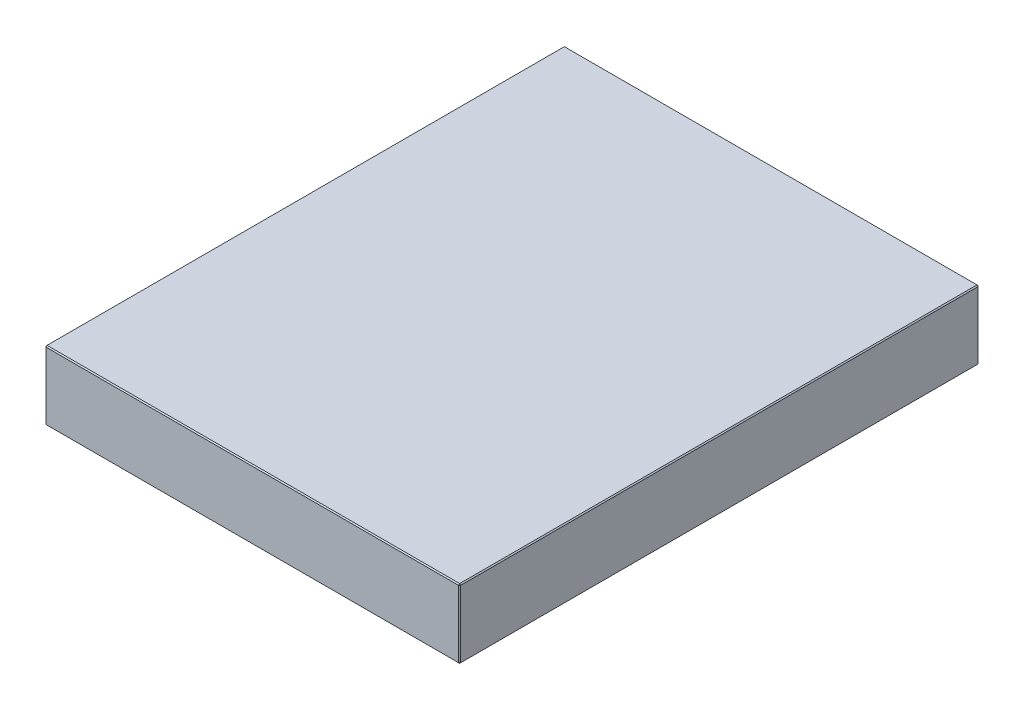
ISO-10303-21;
HEADER;
FILE_DESCRIPTION(('STEP AP214'),'2;1');
FILE_NAME('part.step','',(''),(''),'','','');
FILE_SCHEMA(('AUTOMOTIVE_DESIGN { 1 0 10303 214 1 1 1 1 }'));
ENDSEC;
DATA;
#1=APPLICATION_CONTEXT('core data for automotive mechanical design processes');
#2=APPLICATION_PROTOCOL_DEFINITION('international standard','automotive_design',2000,#1);
#3=PRODUCT_CONTEXT('',#1,'mechanical');
#4=PRODUCT('Part','Part','',(#3));
#5=PRODUCT_RELATED_PRODUCT_CATEGORY('part','',(#4));
#6=PRODUCT_DEFINITION_FORMATION('','',#4);
#7=PRODUCT_DEFINITION_CONTEXT('part definition',#1,'design');
#8=PRODUCT_DEFINITION('design','',#6,#7);
#9=PRODUCT_DEFINITION_SHAPE('','',#8);
#10=(LENGTH_UNIT() NAMED_UNIT(*) SI_UNIT(.MILLI.,.METRE.));
#11=(NAMED_UNIT(*) PLANE_ANGLE_UNIT() SI_UNIT($,.RADIAN.));
#12=(NAMED_UNIT(*) SI_UNIT($,.STERADIAN.) SOLID_ANGLE_UNIT());
#13=UNCERTAINTY_MEASURE_WITH_UNIT(LENGTH_MEASURE(1.E-05),#10,'distance_accuracy_value','');
#14=(GEOMETRIC_REPRESENTATION_CONTEXT(3) GLOBAL_UNCERTAINTY_ASSIGNED_CONTEXT((#13)) GLOBAL_UNIT_ASSIGNED_CONTEXT((#10,
#11,#12)) REPRESENTATION_CONTEXT('',''));
#15=CARTESIAN_POINT('',(0.,0.,0.));
#16=DIRECTION('',(0.,0.,1.));
#17=DIRECTION('',(1.,0.,0.));
#18=AXIS2_PLACEMENT_3D('',#15,#16,#17);
#19=CARTESIAN_POINT('',(-198.,66.,248.));
#20=DIRECTION('',(1.,0.,0.));
#21=DIRECTION('',(0.,0.,-1.));
#22=AXIS2_PLACEMENT_3D('',#19,#20,#21);
#23=PLANE('',#22);
#24=DIRECTION('',(0.,-1.,0.));
#25=VECTOR('',#24,1.);
#26=CARTESIAN_POINT('',(-198.,66.,-247.));
#27=LINE('',#26,#25);
#28=CARTESIAN_POINT('',(-198.,65.,-247.));
#29=VERTEX_POINT('',#28);
#30=CARTESIAN_POINT('',(-198.,1.00000000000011,-247.));
#31=VERTEX_POINT('',#30);
#32=EDGE_CURVE('E114',#29,#31,#27,.T.);
#33=ORIENTED_EDGE('',*,*,#32,.T.);
#34=DIRECTION('',(0.,0.,1.));
#35=VECTOR('',#34,1.);
#36=CARTESIAN_POINT('',(-198.,1.00000000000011,248.));
#37=LINE('',#36,#35);
#38=CARTESIAN_POINT('',(-198.,1.00000000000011,247.));
#39=VERTEX_POINT('',#38);
#40=EDGE_CURVE('E110',#31,#39,#37,.T.);
#41=ORIENTED_EDGE('',*,*,#40,.T.);
#42=DIRECTION('',(0.,1.,0.));
#43=VECTOR('',#42,1.);
#44=CARTESIAN_POINT('',(-198.,66.,247.));
#45=LINE('',#44,#43);
#46=CARTESIAN_POINT('',(-198.,65.,247.));
#47=VERTEX_POINT('',#46);
#48=EDGE_CURVE('E103',#39,#47,#45,.T.);
#49=ORIENTED_EDGE('',*,*,#48,.T.);
#50=DIRECTION('',(0.,0.,-1.));
#51=VECTOR('',#50,1.);
#52=CARTESIAN_POINT('',(-198.,65.,-248.));
#53=LINE('',#52,#51);
#54=EDGE_CURVE('E107',#47,#29,#53,.T.);
#55=ORIENTED_EDGE('',*,*,#54,.T.);
#56=EDGE_LOOP('',(#33,#41,#49,#55));
#57=FACE_BOUND('',#56,.T.);
#58=ADVANCED_FACE('F15',(#57),#23,.F.);
#59=CARTESIAN_POINT('',(198.,66.,248.));
#60=DIRECTION('',(0.,0.,-1.));
#61=DIRECTION('',(-1.,0.,0.));
#62=AXIS2_PLACEMENT_3D('',#59,#60,#61);
#63=PLANE('',#62);
#64=DIRECTION('',(-1.,0.,0.));
#65=VECTOR('',#64,1.);
#66=CARTESIAN_POINT('',(-198.,65.,248.));
#67=LINE('',#66,#65);
#68=CARTESIAN_POINT('',(197.,65.,248.));
#69=VERTEX_POINT('',#68);
#70=CARTESIAN_POINT('',(-197.,65.,248.));
#71=VERTEX_POINT('',#70);
#72=EDGE_CURVE('E164',#69,#71,#67,.T.);
#73=ORIENTED_EDGE('',*,*,#72,.T.);
#74=DIRECTION('',(0.,-1.,0.));
#75=VECTOR('',#74,1.);
#76=CARTESIAN_POINT('',(-197.,66.,248.));
#77=LINE('',#76,#75);
#78=CARTESIAN_POINT('',(-197.,1.00000000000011,248.));
#79=VERTEX_POINT('',#78);
#80=EDGE_CURVE('E122',#71,#79,#77,.T.);
#81=ORIENTED_EDGE('',*,*,#80,.T.);
#82=DIRECTION('',(1.,0.,0.));
#83=VECTOR('',#82,1.);
#84=CARTESIAN_POINT('',(198.,1.00000000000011,248.));
#85=LINE('',#84,#83);
#86=CARTESIAN_POINT('',(197.,1.00000000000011,248.));
#87=VERTEX_POINT('',#86);
#88=EDGE_CURVE('E168',#79,#87,#85,.T.);
#89=ORIENTED_EDGE('',*,*,#88,.T.);
#90=DIRECTION('',(0.,1.,0.));
#91=VECTOR('',#90,1.);
#92=CARTESIAN_POINT('',(197.,66.,248.));
#93=LINE('',#92,#91);
#94=EDGE_CURVE('E166',#87,#69,#93,.T.);
#95=ORIENTED_EDGE('',*,*,#94,.T.);
#96=EDGE_LOOP('',(#73,#81,#89,#95));
#97=FACE_BOUND('',#96,.T.);
#98=ADVANCED_FACE('F275',(#97),#63,.F.);
#99=CARTESIAN_POINT('',(198.,66.,248.));
#100=DIRECTION('',(-1.,0.,0.));
#101=DIRECTION('',(0.,0.,1.));
#102=AXIS2_PLACEMENT_3D('',#99,#100,#101);
#103=PLANE('',#102);
#104=DIRECTION('',(0.,0.,-1.));
#105=VECTOR('',#104,1.);
#106=CARTESIAN_POINT('',(198.,1.00000000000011,248.));
#107=LINE('',#106,#105);
#108=CARTESIAN_POINT('',(198.,1.00000000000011,247.));
#109=VERTEX_POINT('',#108);
#110=CARTESIAN_POINT('',(198.,1.00000000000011,-247.));
#111=VERTEX_POINT('',#110);
#112=EDGE_CURVE('E159',#109,#111,#107,.T.);
#113=ORIENTED_EDGE('',*,*,#112,.T.);
#114=DIRECTION('',(0.,1.,0.));
#115=VECTOR('',#114,1.);
#116=CARTESIAN_POINT('',(198.,66.,-247.));
#117=LINE('',#116,#115);
#118=CARTESIAN_POINT('',(198.,65.,-247.));
#119=VERTEX_POINT('',#118);
#120=EDGE_CURVE('E161',#111,#119,#117,.T.);
#121=ORIENTED_EDGE('',*,*,#120,.T.);
#122=DIRECTION('',(0.,0.,1.));
#123=VECTOR('',#122,1.);
#124=CARTESIAN_POINT('',(198.,65.,248.));
#125=LINE('',#124,#123);
#126=CARTESIAN_POINT('',(198.,65.,247.));
#127=VERTEX_POINT('',#126);
#128=EDGE_CURVE('E155',#119,#127,#125,.T.);
#129=ORIENTED_EDGE('',*,*,#128,.T.);
#130=DIRECTION('',(0.,-1.,0.));
#131=VECTOR('',#130,1.);
#132=CARTESIAN_POINT('',(198.,66.,247.));
#133=LINE('',#132,#131);
#134=EDGE_CURVE('E157',#127,#109,#133,.T.);
#135=ORIENTED_EDGE('',*,*,#134,.T.);
#136=EDGE_LOOP('',(#113,#121,#129,#135));
#137=FACE_BOUND('',#136,.T.);
#138=ADVANCED_FACE('F254',(#137),#103,.F.);
#139=CARTESIAN_POINT('',(198.,66.,-248.));
#140=DIRECTION('',(0.,0.,1.));
#141=DIRECTION('',(1.,0.,0.));
#142=AXIS2_PLACEMENT_3D('',#139,#140,#141);
#143=PLANE('',#142);
#144=DIRECTION('',(0.,-1.,0.));
#145=VECTOR('',#144,1.);
#146=CARTESIAN_POINT('',(197.,66.,-248.));
#147=LINE('',#146,#145);
#148=CARTESIAN_POINT('',(197.,65.,-248.));
#149=VERTEX_POINT('',#148);
#150=CARTESIAN_POINT('',(197.,1.00000000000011,-248.));
#151=VERTEX_POINT('',#150);
#152=EDGE_CURVE('E148',#149,#151,#147,.T.);
#153=ORIENTED_EDGE('',*,*,#152,.T.);
#154=DIRECTION('',(-1.,0.,0.));
#155=VECTOR('',#154,1.);
#156=CARTESIAN_POINT('',(198.,1.00000000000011,-248.));
#157=LINE('',#156,#155);
#158=CARTESIAN_POINT('',(-197.,1.00000000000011,-248.));
#159=VERTEX_POINT('',#158);
#160=EDGE_CURVE('E153',#151,#159,#157,.T.);
#161=ORIENTED_EDGE('',*,*,#160,.T.);
#162=DIRECTION('',(0.,1.,0.));
#163=VECTOR('',#162,1.);
#164=CARTESIAN_POINT('',(-197.,66.,-248.));
#165=LINE('',#164,#163);
#166=CARTESIAN_POINT('',(-197.,65.,-248.));
#167=VERTEX_POINT('',#166);
#168=EDGE_CURVE('E150',#159,#167,#165,.T.);
#169=ORIENTED_EDGE('',*,*,#168,.T.);
#170=DIRECTION('',(1.,0.,0.));
#171=VECTOR('',#170,1.);
#172=CARTESIAN_POINT('',(198.,65.,-248.));
#173=LINE('',#172,#171);
#174=EDGE_CURVE('E146',#167,#149,#173,.T.);
#175=ORIENTED_EDGE('',*,*,#174,.T.);
#176=EDGE_LOOP('',(#153,#161,#169,#175));
#177=FACE_BOUND('',#176,.T.);
#178=ADVANCED_FACE('F284',(#177),#143,.F.);
#179=CARTESIAN_POINT('',(0.,66.,0.));
#180=DIRECTION('',(0.,1.,0.));
#181=DIRECTION('',(0.,0.,1.));
#182=AXIS2_PLACEMENT_3D('',#179,#180,#181);
#183=PLANE('',#182);
#184=DIRECTION('',(0.,0.,-1.));
#185=VECTOR('',#184,1.);
#186=CARTESIAN_POINT('',(197.,66.,-248.));
#187=LINE('',#186,#185);
#188=CARTESIAN_POINT('',(197.,66.,247.));
#189=VERTEX_POINT('',#188);
#190=CARTESIAN_POINT('',(197.,66.,-247.));
#191=VERTEX_POINT('',#190);
#192=EDGE_CURVE('E24',#189,#191,#187,.T.);
#193=ORIENTED_EDGE('',*,*,#192,.T.);
#194=DIRECTION('',(-1.,0.,0.));
#195=VECTOR('',#194,1.);
#196=CARTESIAN_POINT('',(-198.,66.,-247.));
#197=LINE('',#196,#195);
#198=CARTESIAN_POINT('',(-197.,66.,-247.));
#199=VERTEX_POINT('',#198);
#200=EDGE_CURVE('E9',#191,#199,#197,.T.);
#201=ORIENTED_EDGE('',*,*,#200,.T.);
#202=DIRECTION('',(0.,0.,1.));
#203=VECTOR('',#202,1.);
#204=CARTESIAN_POINT('',(-197.,66.,248.));
#205=LINE('',#204,#203);
#206=CARTESIAN_POINT('',(-197.,66.,247.));
#207=VERTEX_POINT('',#206);
#208=EDGE_CURVE('E180',#199,#207,#205,.T.);
#209=ORIENTED_EDGE('',*,*,#208,.T.);
#210=DIRECTION('',(1.,0.,0.));
#211=VECTOR('',#210,1.);
#212=CARTESIAN_POINT('',(198.,66.,247.));
#213=LINE('',#212,#211);
#214=EDGE_CURVE('E35',#207,#189,#213,.T.);
#215=ORIENTED_EDGE('',*,*,#214,.T.);
#216=EDGE_LOOP('',(#193,#201,#209,#215));
#217=FACE_BOUND('',#216,.T.);
#218=ADVANCED_FACE('F350',(#217),#183,.T.);
#219=CARTESIAN_POINT('',(0.,0.,0.));
#220=DIRECTION('',(0.,1.,0.));
#221=DIRECTION('',(0.,0.,1.));
#222=AXIS2_PLACEMENT_3D('',#219,#220,#221);
#223=PLANE('',#222);
#224=DIRECTION('',(0.,0.,1.));
#225=VECTOR('',#224,1.);
#226=CARTESIAN_POINT('',(197.,0.,0.));
#227=LINE('',#226,#225);
#228=CARTESIAN_POINT('',(197.,0.,-247.));
#229=VERTEX_POINT('',#228);
#230=CARTESIAN_POINT('',(197.,0.,247.));
#231=VERTEX_POINT('',#230);
#232=EDGE_CURVE('E171',#229,#231,#227,.T.);
#233=ORIENTED_EDGE('',*,*,#232,.T.);
#234=DIRECTION('',(-1.,0.,0.));
#235=VECTOR('',#234,1.);
#236=CARTESIAN_POINT('',(0.,0.,247.));
#237=LINE('',#236,#235);
#238=CARTESIAN_POINT('',(-197.,0.,247.));
#239=VERTEX_POINT('',#238);
#240=EDGE_CURVE('E177',#231,#239,#237,.T.);
#241=ORIENTED_EDGE('',*,*,#240,.T.);
#242=DIRECTION('',(0.,0.,-1.));
#243=VECTOR('',#242,1.);
#244=CARTESIAN_POINT('',(-197.,0.,0.));
#245=LINE('',#244,#243);
#246=CARTESIAN_POINT('',(-197.,0.,-247.));
#247=VERTEX_POINT('',#246);
#248=EDGE_CURVE('E175',#239,#247,#245,.T.);
#249=ORIENTED_EDGE('',*,*,#248,.T.);
#250=DIRECTION('',(1.,0.,0.));
#251=VECTOR('',#250,1.);
#252=CARTESIAN_POINT('',(0.,0.,-247.));
#253=LINE('',#252,#251);
#254=EDGE_CURVE('E173',#247,#229,#253,.T.);
#255=ORIENTED_EDGE('',*,*,#254,.T.);
#256=EDGE_LOOP('',(#233,#241,#249,#255));
#257=FACE_BOUND('',#256,.T.);
#258=ADVANCED_FACE('F246',(#257),#223,.F.);
#259=CARTESIAN_POINT('',(198.,66.,247.));
#260=DIRECTION('',(-0.707106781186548,0.,-0.707106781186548));
#261=DIRECTION('',(0.,-1.,0.));
#262=AXIS2_PLACEMENT_3D('',#259,#260,#261);
#263=PLANE('',#262);
#264=DIRECTION('',(-0.707106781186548,0.,0.707106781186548));
#265=VECTOR('',#264,1.);
#266=CARTESIAN_POINT('',(197.,65.,248.));
#267=LINE('',#266,#265);
#268=EDGE_CURVE('E19',#69,#127,#267,.F.);
#269=ORIENTED_EDGE('',*,*,#268,.F.);
#270=ORIENTED_EDGE('',*,*,#94,.F.);
#271=DIRECTION('',(0.707106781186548,0.,-0.707106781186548));
#272=VECTOR('',#271,1.);
#273=CARTESIAN_POINT('',(197.,1.00000000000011,248.));
#274=LINE('',#273,#272);
#275=EDGE_CURVE('E142',#109,#87,#274,.F.);
#276=ORIENTED_EDGE('',*,*,#275,.F.);
#277=ORIENTED_EDGE('',*,*,#134,.F.);
#278=EDGE_LOOP('',(#269,#270,#276,#277));
#279=FACE_BOUND('',#278,.T.);
#280=ADVANCED_FACE('F17',(#279),#263,.F.);
#281=CARTESIAN_POINT('',(197.,65.,248.));
#282=DIRECTION('',(0.577350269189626,0.577350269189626,0.577350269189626));
#283=DIRECTION('',(0.707106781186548,0.,-0.707106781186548));
#284=AXIS2_PLACEMENT_3D('',#281,#282,#283);
#285=PLANE('',#284);
#286=DIRECTION('',(0.,-0.707106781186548,0.707106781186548));
#287=VECTOR('',#286,1.);
#288=CARTESIAN_POINT('',(197.,65.,248.));
#289=LINE('',#288,#287);
#290=EDGE_CURVE('E226',#69,#189,#289,.F.);
#291=ORIENTED_EDGE('',*,*,#290,.F.);
#292=ORIENTED_EDGE('',*,*,#268,.T.);
#293=DIRECTION('',(-0.707106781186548,0.707106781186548,0.));
#294=VECTOR('',#293,1.);
#295=CARTESIAN_POINT('',(197.5,65.5,247.));
#296=LINE('',#295,#294);
#297=EDGE_CURVE('E228',#189,#127,#296,.F.);
#298=ORIENTED_EDGE('',*,*,#297,.F.);
#299=EDGE_LOOP('',(#291,#292,#298));
#300=FACE_BOUND('',#299,.T.);
#301=ADVANCED_FACE('F270',(#300),#285,.T.);
#302=CARTESIAN_POINT('',(197.,1.00000000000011,248.));
#303=DIRECTION('',(0.577350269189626,-0.577350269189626,0.577350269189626));
#304=DIRECTION('',(0.707106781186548,0.,-0.707106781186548));
#305=AXIS2_PLACEMENT_3D('',#302,#303,#304);
#306=PLANE('',#305);
#307=DIRECTION('',(-0.707106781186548,-0.707106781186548,0.));
#308=VECTOR('',#307,1.);
#309=CARTESIAN_POINT('',(197.5,0.500000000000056,247.));
#310=LINE('',#309,#308);
#311=EDGE_CURVE('E220',#109,#231,#310,.T.);
#312=ORIENTED_EDGE('',*,*,#311,.F.);
#313=ORIENTED_EDGE('',*,*,#275,.T.);
#314=DIRECTION('',(0.,0.707106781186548,0.707106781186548));
#315=VECTOR('',#314,1.);
#316=CARTESIAN_POINT('',(197.,1.00000000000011,248.));
#317=LINE('',#316,#315);
#318=EDGE_CURVE('E223',#231,#87,#317,.T.);
#319=ORIENTED_EDGE('',*,*,#318,.F.);
#320=EDGE_LOOP('',(#312,#313,#319));
#321=FACE_BOUND('',#320,.T.);
#322=ADVANCED_FACE('F235',(#321),#306,.T.);
#323=CARTESIAN_POINT('',(197.,66.,0.));
#324=DIRECTION('',(0.707106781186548,0.707106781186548,0.));
#325=DIRECTION('',(0.,0.,1.));
#326=AXIS2_PLACEMENT_3D('',#323,#324,#325);
#327=PLANE('',#326);
#328=ORIENTED_EDGE('',*,*,#297,.T.);
#329=ORIENTED_EDGE('',*,*,#128,.F.);
#330=DIRECTION('',(0.707106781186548,-0.707106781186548,0.));
#331=VECTOR('',#330,1.);
#332=CARTESIAN_POINT('',(198.,65.,-247.));
#333=LINE('',#332,#331);
#334=EDGE_CURVE('E215',#191,#119,#333,.T.);
#335=ORIENTED_EDGE('',*,*,#334,.F.);
#336=ORIENTED_EDGE('',*,*,#192,.F.);
#337=EDGE_LOOP('',(#328,#329,#335,#336));
#338=FACE_BOUND('',#337,.T.);
#339=ADVANCED_FACE('F265',(#338),#327,.T.);
#340=CARTESIAN_POINT('',(0.,66.,247.));
#341=DIRECTION('',(0.,0.707106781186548,0.707106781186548));
#342=DIRECTION('',(-1.,0.,0.));
#343=AXIS2_PLACEMENT_3D('',#340,#341,#342);
#344=PLANE('',#343);
#345=ORIENTED_EDGE('',*,*,#290,.T.);
#346=ORIENTED_EDGE('',*,*,#214,.F.);
#347=DIRECTION('',(0.,0.707106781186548,-0.707106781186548));
#348=VECTOR('',#347,1.);
#349=CARTESIAN_POINT('',(-197.,65.5,247.5));
#350=LINE('',#349,#348);
#351=EDGE_CURVE('E126',#71,#207,#350,.T.);
#352=ORIENTED_EDGE('',*,*,#351,.F.);
#353=ORIENTED_EDGE('',*,*,#72,.F.);
#354=EDGE_LOOP('',(#345,#346,#352,#353));
#355=FACE_BOUND('',#354,.T.);
#356=ADVANCED_FACE('F273',(#355),#344,.T.);
#357=CARTESIAN_POINT('',(-197.,66.,248.));
#358=DIRECTION('',(0.707106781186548,0.,-0.707106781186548));
#359=DIRECTION('',(0.,-1.,0.));
#360=AXIS2_PLACEMENT_3D('',#357,#358,#359);
#361=PLANE('',#360);
#362=DIRECTION('',(0.707106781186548,0.,0.707106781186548));
#363=VECTOR('',#362,1.);
#364=CARTESIAN_POINT('',(-197.,1.00000000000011,248.));
#365=LINE('',#364,#363);
#366=EDGE_CURVE('E127',#79,#39,#365,.F.);
#367=ORIENTED_EDGE('',*,*,#366,.F.);
#368=ORIENTED_EDGE('',*,*,#80,.F.);
#369=DIRECTION('',(-0.707106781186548,0.,-0.707106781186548));
#370=VECTOR('',#369,1.);
#371=CARTESIAN_POINT('',(-198.,65.,247.));
#372=LINE('',#371,#370);
#373=EDGE_CURVE('E118',#47,#71,#372,.F.);
#374=ORIENTED_EDGE('',*,*,#373,.F.);
#375=ORIENTED_EDGE('',*,*,#48,.F.);
#376=EDGE_LOOP('',(#367,#368,#374,#375));
#377=FACE_BOUND('',#376,.T.);
#378=ADVANCED_FACE('F120',(#377),#361,.F.);
#379=CARTESIAN_POINT('',(198.,1.00000000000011,248.));
#380=DIRECTION('',(0.,0.707106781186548,-0.707106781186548));
#381=DIRECTION('',(1.,0.,0.));
#382=AXIS2_PLACEMENT_3D('',#379,#380,#381);
#383=PLANE('',#382);
#384=ORIENTED_EDGE('',*,*,#318,.T.);
#385=ORIENTED_EDGE('',*,*,#88,.F.);
#386=DIRECTION('',(0.,-0.707106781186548,-0.707106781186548));
#387=VECTOR('',#386,1.);
#388=CARTESIAN_POINT('',(-197.,1.00000000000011,248.));
#389=LINE('',#388,#387);
#390=EDGE_CURVE('E211',#239,#79,#389,.F.);
#391=ORIENTED_EDGE('',*,*,#390,.F.);
#392=ORIENTED_EDGE('',*,*,#240,.F.);
#393=EDGE_LOOP('',(#384,#385,#391,#392));
#394=FACE_BOUND('',#393,.T.);
#395=ADVANCED_FACE('F243',(#394),#383,.F.);
#396=CARTESIAN_POINT('',(198.,1.00000000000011,248.));
#397=DIRECTION('',(-0.707106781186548,0.707106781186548,0.));
#398=DIRECTION('',(0.,0.,-1.));
#399=AXIS2_PLACEMENT_3D('',#396,#397,#398);
#400=PLANE('',#399);
#401=ORIENTED_EDGE('',*,*,#311,.T.);
#402=ORIENTED_EDGE('',*,*,#232,.F.);
#403=DIRECTION('',(0.707106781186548,0.707106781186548,0.));
#404=VECTOR('',#403,1.);
#405=CARTESIAN_POINT('',(197.5,0.50000000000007,-247.));
#406=LINE('',#405,#404);
#407=EDGE_CURVE('E208',#111,#229,#406,.F.);
#408=ORIENTED_EDGE('',*,*,#407,.F.);
#409=ORIENTED_EDGE('',*,*,#112,.F.);
#410=EDGE_LOOP('',(#401,#402,#408,#409));
#411=FACE_BOUND('',#410,.T.);
#412=ADVANCED_FACE('F251',(#411),#400,.F.);
#413=CARTESIAN_POINT('',(197.,66.,-248.));
#414=DIRECTION('',(-0.707106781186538,0.,0.707106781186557));
#415=DIRECTION('',(0.,-1.,0.));
#416=AXIS2_PLACEMENT_3D('',#413,#414,#415);
#417=PLANE('',#416);
#418=DIRECTION('',(0.707106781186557,0.,0.707106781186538));
#419=VECTOR('',#418,1.);
#420=CARTESIAN_POINT('',(198.,65.,-247.));
#421=LINE('',#420,#419);
#422=EDGE_CURVE('E217',#119,#149,#421,.F.);
#423=ORIENTED_EDGE('',*,*,#422,.F.);
#424=ORIENTED_EDGE('',*,*,#120,.F.);
#425=DIRECTION('',(-0.707106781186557,0.,-0.707106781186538));
#426=VECTOR('',#425,1.);
#427=CARTESIAN_POINT('',(197.,1.00000000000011,-248.));
#428=LINE('',#427,#426);
#429=EDGE_CURVE('E205',#151,#111,#428,.F.);
#430=ORIENTED_EDGE('',*,*,#429,.F.);
#431=ORIENTED_EDGE('',*,*,#152,.F.);
#432=EDGE_LOOP('',(#423,#424,#430,#431));
#433=FACE_BOUND('',#432,.T.);
#434=ADVANCED_FACE('F258',(#433),#417,.F.);
#435=CARTESIAN_POINT('',(198.,65.,-247.));
#436=DIRECTION('',(0.577350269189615,0.577350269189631,-0.577350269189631));
#437=DIRECTION('',(0.,0.707106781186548,0.707106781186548));
#438=AXIS2_PLACEMENT_3D('',#435,#436,#437);
#439=PLANE('',#438);
#440=ORIENTED_EDGE('',*,*,#334,.T.);
#441=ORIENTED_EDGE('',*,*,#422,.T.);
#442=DIRECTION('',(0.,0.707106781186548,0.707106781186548));
#443=VECTOR('',#442,1.);
#444=CARTESIAN_POINT('',(197.,65.5,-247.5));
#445=LINE('',#444,#443);
#446=EDGE_CURVE('E134',#191,#149,#445,.F.);
#447=ORIENTED_EDGE('',*,*,#446,.F.);
#448=EDGE_LOOP('',(#440,#441,#447));
#449=FACE_BOUND('',#448,.T.);
#450=ADVANCED_FACE('F325',(#449),#439,.T.);
#451=CARTESIAN_POINT('',(-198.,65.,247.));
#452=DIRECTION('',(-0.577350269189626,0.577350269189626,0.577350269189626));
#453=DIRECTION('',(0.707106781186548,0.,0.707106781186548));
#454=AXIS2_PLACEMENT_3D('',#451,#452,#453);
#455=PLANE('',#454);
#456=ORIENTED_EDGE('',*,*,#373,.T.);
#457=ORIENTED_EDGE('',*,*,#351,.T.);
#458=DIRECTION('',(-0.707106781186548,-0.707106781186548,0.));
#459=VECTOR('',#458,1.);
#460=CARTESIAN_POINT('',(-198.,65.,247.));
#461=LINE('',#460,#459);
#462=EDGE_CURVE('E130',#47,#207,#461,.F.);
#463=ORIENTED_EDGE('',*,*,#462,.F.);
#464=EDGE_LOOP('',(#456,#457,#463));
#465=FACE_BOUND('',#464,.T.);
#466=ADVANCED_FACE('F131',(#465),#455,.T.);
#467=CARTESIAN_POINT('',(-197.,1.00000000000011,248.));
#468=DIRECTION('',(-0.577350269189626,-0.577350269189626,0.577350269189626));
#469=DIRECTION('',(0.707106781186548,0.,0.707106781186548));
#470=AXIS2_PLACEMENT_3D('',#467,#468,#469);
#471=PLANE('',#470);
#472=ORIENTED_EDGE('',*,*,#390,.T.);
#473=ORIENTED_EDGE('',*,*,#366,.T.);
#474=DIRECTION('',(-0.707106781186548,0.707106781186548,0.));
#475=VECTOR('',#474,1.);
#476=CARTESIAN_POINT('',(-197.5,0.500000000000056,247.));
#477=LINE('',#476,#475);
#478=EDGE_CURVE('E135',#239,#39,#477,.T.);
#479=ORIENTED_EDGE('',*,*,#478,.F.);
#480=EDGE_LOOP('',(#472,#473,#479));
#481=FACE_BOUND('',#480,.T.);
#482=ADVANCED_FACE('F318',(#481),#471,.T.);
#483=CARTESIAN_POINT('',(197.,1.00000000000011,-248.));
#484=DIRECTION('',(0.577350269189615,-0.577350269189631,-0.577350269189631));
#485=DIRECTION('',(0.,0.707106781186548,-0.707106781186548));
#486=AXIS2_PLACEMENT_3D('',#483,#484,#485);
#487=PLANE('',#486);
#488=ORIENTED_EDGE('',*,*,#429,.T.);
#489=ORIENTED_EDGE('',*,*,#407,.T.);
#490=DIRECTION('',(0.,-0.707106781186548,0.707106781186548));
#491=VECTOR('',#490,1.);
#492=CARTESIAN_POINT('',(197.,1.00000000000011,-248.));
#493=LINE('',#492,#491);
#494=EDGE_CURVE('E198',#151,#229,#493,.T.);
#495=ORIENTED_EDGE('',*,*,#494,.F.);
#496=EDGE_LOOP('',(#488,#489,#495));
#497=FACE_BOUND('',#496,.T.);
#498=ADVANCED_FACE('F314',(#497),#487,.T.);
#499=CARTESIAN_POINT('',(0.,66.,-247.));
#500=DIRECTION('',(0.,0.707106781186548,-0.707106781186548));
#501=DIRECTION('',(1.,0.,0.));
#502=AXIS2_PLACEMENT_3D('',#499,#500,#501);
#503=PLANE('',#502);
#504=ORIENTED_EDGE('',*,*,#446,.T.);
#505=ORIENTED_EDGE('',*,*,#174,.F.);
#506=DIRECTION('',(0.,-0.707106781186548,-0.707106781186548));
#507=VECTOR('',#506,1.);
#508=CARTESIAN_POINT('',(-197.,65.,-248.));
#509=LINE('',#508,#507);
#510=EDGE_CURVE('E195',#199,#167,#509,.T.);
#511=ORIENTED_EDGE('',*,*,#510,.F.);
#512=ORIENTED_EDGE('',*,*,#200,.F.);
#513=EDGE_LOOP('',(#504,#505,#511,#512));
#514=FACE_BOUND('',#513,.T.);
#515=ADVANCED_FACE('F311',(#514),#503,.T.);
#516=CARTESIAN_POINT('',(-197.,66.,0.));
#517=DIRECTION('',(-0.707106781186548,0.707106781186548,0.));
#518=DIRECTION('',(0.,0.,-1.));
#519=AXIS2_PLACEMENT_3D('',#516,#517,#518);
#520=PLANE('',#519);
#521=ORIENTED_EDGE('',*,*,#462,.T.);
#522=ORIENTED_EDGE('',*,*,#208,.F.);
#523=DIRECTION('',(0.707106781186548,0.707106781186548,0.));
#524=VECTOR('',#523,1.);
#525=CARTESIAN_POINT('',(-197.5,65.5,-247.));
#526=LINE('',#525,#524);
#527=EDGE_CURVE('E138',#29,#199,#526,.T.);
#528=ORIENTED_EDGE('',*,*,#527,.F.);
#529=ORIENTED_EDGE('',*,*,#54,.F.);
#530=EDGE_LOOP('',(#521,#522,#528,#529));
#531=FACE_BOUND('',#530,.T.);
#532=ADVANCED_FACE('F137',(#531),#520,.T.);
#533=CARTESIAN_POINT('',(-198.,1.00000000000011,248.));
#534=DIRECTION('',(0.707106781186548,0.707106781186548,0.));
#535=DIRECTION('',(0.,0.,1.));
#536=AXIS2_PLACEMENT_3D('',#533,#534,#535);
#537=PLANE('',#536);
#538=ORIENTED_EDGE('',*,*,#478,.T.);
#539=ORIENTED_EDGE('',*,*,#40,.F.);
#540=DIRECTION('',(0.707106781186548,-0.707106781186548,0.));
#541=VECTOR('',#540,1.);
#542=CARTESIAN_POINT('',(-198.,1.00000000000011,-247.));
#543=LINE('',#542,#541);
#544=EDGE_CURVE('E191',#247,#31,#543,.F.);
#545=ORIENTED_EDGE('',*,*,#544,.F.);
#546=ORIENTED_EDGE('',*,*,#248,.F.);
#547=EDGE_LOOP('',(#538,#539,#545,#546));
#548=FACE_BOUND('',#547,.T.);
#549=ADVANCED_FACE('F304',(#548),#537,.F.);
#550=CARTESIAN_POINT('',(198.,1.00000000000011,-248.));
#551=DIRECTION('',(0.,0.707106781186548,0.707106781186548));
#552=DIRECTION('',(-1.,0.,0.));
#553=AXIS2_PLACEMENT_3D('',#550,#551,#552);
#554=PLANE('',#553);
#555=ORIENTED_EDGE('',*,*,#494,.T.);
#556=ORIENTED_EDGE('',*,*,#254,.F.);
#557=DIRECTION('',(0.,0.707106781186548,-0.707106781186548));
#558=VECTOR('',#557,1.);
#559=CARTESIAN_POINT('',(-197.,0.500000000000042,-247.5));
#560=LINE('',#559,#558);
#561=EDGE_CURVE('E188',#159,#247,#560,.F.);
#562=ORIENTED_EDGE('',*,*,#561,.F.);
#563=ORIENTED_EDGE('',*,*,#160,.F.);
#564=EDGE_LOOP('',(#555,#556,#562,#563));
#565=FACE_BOUND('',#564,.T.);
#566=ADVANCED_FACE('F300',(#565),#554,.F.);
#567=CARTESIAN_POINT('',(-197.,65.,-248.));
#568=DIRECTION('',(-0.577350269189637,0.577350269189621,-0.577350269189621));
#569=DIRECTION('',(-0.707106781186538,0.,0.707106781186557));
#570=AXIS2_PLACEMENT_3D('',#567,#568,#569);
#571=PLANE('',#570);
#572=ORIENTED_EDGE('',*,*,#527,.T.);
#573=ORIENTED_EDGE('',*,*,#510,.T.);
#574=DIRECTION('',(0.707106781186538,0.,-0.707106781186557));
#575=VECTOR('',#574,1.);
#576=CARTESIAN_POINT('',(-197.,65.,-248.));
#577=LINE('',#576,#575);
#578=EDGE_CURVE('E186',#29,#167,#577,.T.);
#579=ORIENTED_EDGE('',*,*,#578,.F.);
#580=EDGE_LOOP('',(#572,#573,#579));
#581=FACE_BOUND('',#580,.T.);
#582=ADVANCED_FACE('F296',(#581),#571,.T.);
#583=CARTESIAN_POINT('',(-198.,1.00000000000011,-247.));
#584=DIRECTION('',(-0.577350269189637,-0.577350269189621,-0.577350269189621));
#585=DIRECTION('',(-0.707106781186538,0.,0.707106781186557));
#586=AXIS2_PLACEMENT_3D('',#583,#584,#585);
#587=PLANE('',#586);
#588=ORIENTED_EDGE('',*,*,#561,.T.);
#589=ORIENTED_EDGE('',*,*,#544,.T.);
#590=DIRECTION('',(-0.707106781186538,0.,0.707106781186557));
#591=VECTOR('',#590,1.);
#592=CARTESIAN_POINT('',(-198.,1.00000000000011,-247.));
#593=LINE('',#592,#591);
#594=EDGE_CURVE('E184',#159,#31,#593,.T.);
#595=ORIENTED_EDGE('',*,*,#594,.F.);
#596=EDGE_LOOP('',(#588,#589,#595));
#597=FACE_BOUND('',#596,.T.);
#598=ADVANCED_FACE('F292',(#597),#587,.T.);
#599=CARTESIAN_POINT('',(-198.,66.,-247.));
#600=DIRECTION('',(0.707106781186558,0.,0.707106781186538));
#601=DIRECTION('',(0.,-1.,0.));
#602=AXIS2_PLACEMENT_3D('',#599,#600,#601);
#603=PLANE('',#602);
#604=ORIENTED_EDGE('',*,*,#578,.T.);
#605=ORIENTED_EDGE('',*,*,#168,.F.);
#606=ORIENTED_EDGE('',*,*,#594,.T.);
#607=ORIENTED_EDGE('',*,*,#32,.F.);
#608=EDGE_LOOP('',(#604,#605,#606,#607));
#609=FACE_BOUND('',#608,.T.);
#610=ADVANCED_FACE('F289',(#609),#603,.F.);
#611=CLOSED_SHELL('',(#58,#98,#138,#178,#218,#258,#280,#301,#322,#339,#356,#378,#395,#412,#434,
#450,#466,#482,#498,#515,#532,#549,#566,#582,#598,#610));
#612=MANIFOLD_SOLID_BREP('B1',#611);
#613=ADVANCED_BREP_SHAPE_REPRESENTATION('',(#18,#612),#14);
#614=SHAPE_DEFINITION_REPRESENTATION(#9,#613);
ENDSEC;
END-ISO-10303-21;
